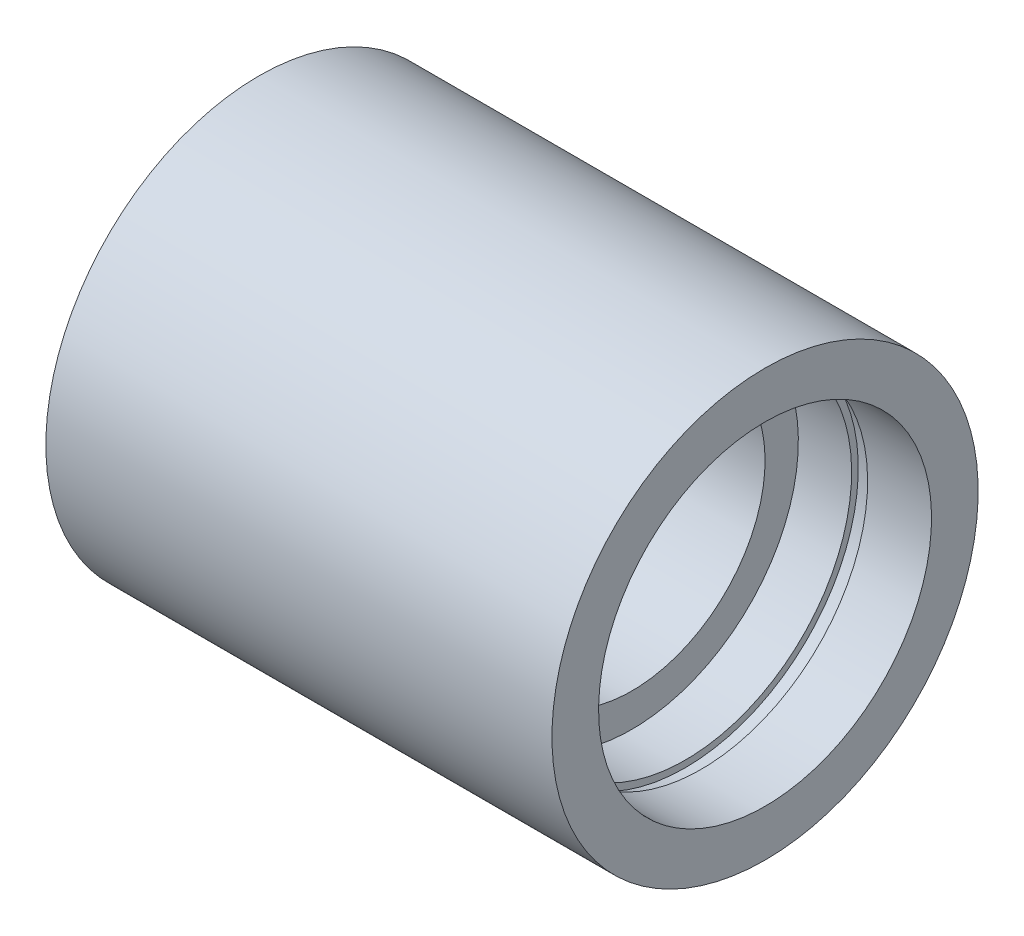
ISO-10303-21;
HEADER;
FILE_DESCRIPTION(('STEP AP214'),'2;1');
FILE_NAME('part.step','',(''),(''),'','','');
FILE_SCHEMA(('AUTOMOTIVE_DESIGN { 1 0 10303 214 1 1 1 1 }'));
ENDSEC;
DATA;
#1=APPLICATION_CONTEXT('core data for automotive mechanical design processes');
#2=APPLICATION_PROTOCOL_DEFINITION('international standard','automotive_design',2000,#1);
#3=PRODUCT_CONTEXT('',#1,'mechanical');
#4=PRODUCT('Part','Part','',(#3));
#5=PRODUCT_RELATED_PRODUCT_CATEGORY('part','',(#4));
#6=PRODUCT_DEFINITION_FORMATION('','',#4);
#7=PRODUCT_DEFINITION_CONTEXT('part definition',#1,'design');
#8=PRODUCT_DEFINITION('design','',#6,#7);
#9=PRODUCT_DEFINITION_SHAPE('','',#8);
#10=(LENGTH_UNIT() NAMED_UNIT(*) SI_UNIT(.MILLI.,.METRE.));
#11=(NAMED_UNIT(*) PLANE_ANGLE_UNIT() SI_UNIT($,.RADIAN.));
#12=(NAMED_UNIT(*) SI_UNIT($,.STERADIAN.) SOLID_ANGLE_UNIT());
#13=UNCERTAINTY_MEASURE_WITH_UNIT(LENGTH_MEASURE(1.E-05),#10,'distance_accuracy_value','');
#14=(GEOMETRIC_REPRESENTATION_CONTEXT(3) GLOBAL_UNCERTAINTY_ASSIGNED_CONTEXT((#13)) GLOBAL_UNIT_ASSIGNED_CONTEXT((#10,
#11,#12)) REPRESENTATION_CONTEXT('',''));
#15=CARTESIAN_POINT('',(0.,0.,0.));
#16=DIRECTION('',(0.,0.,1.));
#17=DIRECTION('',(1.,0.,0.));
#18=AXIS2_PLACEMENT_3D('',#15,#16,#17);
#19=CARTESIAN_POINT('',(0.,0.,0.));
#20=DIRECTION('',(1.,0.,0.));
#21=DIRECTION('',(0.,0.999999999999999,0.));
#22=AXIS2_PLACEMENT_3D('',#19,#20,#21);
#23=CYLINDRICAL_SURFACE('',#22,16.);
#24=CARTESIAN_POINT('',(-38.,0.,0.));
#25=DIRECTION('',(1.,0.,0.));
#26=DIRECTION('',(0.,0.999999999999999,0.));
#27=AXIS2_PLACEMENT_3D('',#24,#25,#26);
#28=CIRCLE('',#27,16.);
#29=CARTESIAN_POINT('',(-38.,16.,0.));
#30=VERTEX_POINT('',#29);
#31=EDGE_CURVE('E12',#30,#30,#28,.T.);
#32=ORIENTED_EDGE('',*,*,#31,.T.);
#33=EDGE_LOOP('',(#32));
#34=FACE_BOUND('',#33,.T.);
#35=CARTESIAN_POINT('',(0.,0.,0.));
#36=DIRECTION('',(1.,0.,0.));
#37=DIRECTION('',(0.,0.999999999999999,0.));
#38=AXIS2_PLACEMENT_3D('',#35,#36,#37);
#39=CIRCLE('',#38,16.);
#40=CARTESIAN_POINT('',(0.,16.,0.));
#41=VERTEX_POINT('',#40);
#42=EDGE_CURVE('E84',#41,#41,#39,.T.);
#43=ORIENTED_EDGE('',*,*,#42,.F.);
#44=EDGE_LOOP('',(#43));
#45=FACE_BOUND('',#44,.T.);
#46=ADVANCED_FACE('F38',(#34,#45),#23,.T.);
#47=CARTESIAN_POINT('',(-38.,16.,0.));
#48=DIRECTION('',(-1.,0.,0.));
#49=DIRECTION('',(0.,-0.999999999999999,0.));
#50=AXIS2_PLACEMENT_3D('',#47,#48,#49);
#51=PLANE('',#50);
#52=CARTESIAN_POINT('',(-38.,0.,0.));
#53=DIRECTION('',(1.,0.,0.));
#54=DIRECTION('',(0.,0.999999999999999,0.));
#55=AXIS2_PLACEMENT_3D('',#52,#53,#54);
#56=CIRCLE('',#55,12.5);
#57=CARTESIAN_POINT('',(-38.,12.5,0.));
#58=VERTEX_POINT('',#57);
#59=EDGE_CURVE('E44',#58,#58,#56,.T.);
#60=ORIENTED_EDGE('',*,*,#59,.T.);
#61=EDGE_LOOP('',(#60));
#62=FACE_BOUND('',#61,.T.);
#63=ORIENTED_EDGE('',*,*,#31,.F.);
#64=EDGE_LOOP('',(#63));
#65=FACE_BOUND('',#64,.T.);
#66=ADVANCED_FACE('F92',(#62,#65),#51,.T.);
#67=CARTESIAN_POINT('',(0.,0.,0.));
#68=DIRECTION('',(1.,0.,0.));
#69=DIRECTION('',(0.,0.999999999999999,0.));
#70=AXIS2_PLACEMENT_3D('',#67,#68,#69);
#71=CYLINDRICAL_SURFACE('',#70,12.5);
#72=CARTESIAN_POINT('',(-29.,0.,0.));
#73=DIRECTION('',(1.,0.,0.));
#74=DIRECTION('',(0.,0.999999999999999,0.));
#75=AXIS2_PLACEMENT_3D('',#72,#73,#74);
#76=CIRCLE('',#75,12.5);
#77=CARTESIAN_POINT('',(-29.,12.5,0.));
#78=VERTEX_POINT('',#77);
#79=EDGE_CURVE('E48',#78,#78,#76,.T.);
#80=ORIENTED_EDGE('',*,*,#79,.T.);
#81=EDGE_LOOP('',(#80));
#82=FACE_BOUND('',#81,.T.);
#83=ORIENTED_EDGE('',*,*,#59,.F.);
#84=EDGE_LOOP('',(#83));
#85=FACE_BOUND('',#84,.T.);
#86=ADVANCED_FACE('F96',(#82,#85),#71,.F.);
#87=CARTESIAN_POINT('',(-29.,12.5,0.));
#88=DIRECTION('',(-1.,0.,0.));
#89=DIRECTION('',(0.,-0.999999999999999,0.));
#90=AXIS2_PLACEMENT_3D('',#87,#88,#89);
#91=PLANE('',#90);
#92=CARTESIAN_POINT('',(-29.,0.,0.));
#93=DIRECTION('',(1.,0.,0.));
#94=DIRECTION('',(0.,0.999999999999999,0.));
#95=AXIS2_PLACEMENT_3D('',#92,#93,#94);
#96=CIRCLE('',#95,4.);
#97=CARTESIAN_POINT('',(-29.,3.99999999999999,0.));
#98=VERTEX_POINT('',#97);
#99=EDGE_CURVE('E52',#98,#98,#96,.T.);
#100=ORIENTED_EDGE('',*,*,#99,.T.);
#101=EDGE_LOOP('',(#100));
#102=FACE_BOUND('',#101,.T.);
#103=ORIENTED_EDGE('',*,*,#79,.F.);
#104=EDGE_LOOP('',(#103));
#105=FACE_BOUND('',#104,.T.);
#106=ADVANCED_FACE('F100',(#102,#105),#91,.T.);
#107=CARTESIAN_POINT('',(0.,0.,0.));
#108=DIRECTION('',(1.,0.,0.));
#109=DIRECTION('',(0.,0.999999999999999,0.));
#110=AXIS2_PLACEMENT_3D('',#107,#108,#109);
#111=CYLINDRICAL_SURFACE('',#110,4.);
#112=CARTESIAN_POINT('',(-24.,0.,0.));
#113=DIRECTION('',(1.,0.,0.));
#114=DIRECTION('',(0.,0.999999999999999,0.));
#115=AXIS2_PLACEMENT_3D('',#112,#113,#114);
#116=CIRCLE('',#115,4.);
#117=CARTESIAN_POINT('',(-24.,3.99999999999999,0.));
#118=VERTEX_POINT('',#117);
#119=EDGE_CURVE('E57',#118,#118,#116,.T.);
#120=ORIENTED_EDGE('',*,*,#119,.T.);
#121=EDGE_LOOP('',(#120));
#122=FACE_BOUND('',#121,.T.);
#123=ORIENTED_EDGE('',*,*,#99,.F.);
#124=EDGE_LOOP('',(#123));
#125=FACE_BOUND('',#124,.T.);
#126=ADVANCED_FACE('F107',(#122,#125),#111,.F.);
#127=CARTESIAN_POINT('',(-24.,3.99999999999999,0.));
#128=DIRECTION('',(1.,0.,0.));
#129=DIRECTION('',(0.,0.999999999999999,0.));
#130=AXIS2_PLACEMENT_3D('',#127,#128,#129);
#131=PLANE('',#130);
#132=CARTESIAN_POINT('',(-24.,0.,0.));
#133=DIRECTION('',(1.,0.,0.));
#134=DIRECTION('',(0.,0.999999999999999,0.));
#135=AXIS2_PLACEMENT_3D('',#132,#133,#134);
#136=CIRCLE('',#135,10.);
#137=CARTESIAN_POINT('',(-24.,9.99999999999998,0.));
#138=VERTEX_POINT('',#137);
#139=EDGE_CURVE('E60',#138,#138,#136,.T.);
#140=ORIENTED_EDGE('',*,*,#139,.T.);
#141=EDGE_LOOP('',(#140));
#142=FACE_BOUND('',#141,.T.);
#143=ORIENTED_EDGE('',*,*,#119,.F.);
#144=EDGE_LOOP('',(#143));
#145=FACE_BOUND('',#144,.T.);
#146=ADVANCED_FACE('F111',(#142,#145),#131,.T.);
#147=CARTESIAN_POINT('',(0.,0.,0.));
#148=DIRECTION('',(1.,0.,0.));
#149=DIRECTION('',(0.,0.999999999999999,0.));
#150=AXIS2_PLACEMENT_3D('',#147,#148,#149);
#151=CYLINDRICAL_SURFACE('',#150,10.);
#152=CARTESIAN_POINT('',(-10.,0.,0.));
#153=DIRECTION('',(1.,0.,0.));
#154=DIRECTION('',(0.,0.999999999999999,0.));
#155=AXIS2_PLACEMENT_3D('',#152,#153,#154);
#156=CIRCLE('',#155,10.);
#157=CARTESIAN_POINT('',(-10.,9.99999999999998,0.));
#158=VERTEX_POINT('',#157);
#159=EDGE_CURVE('E63',#158,#158,#156,.T.);
#160=ORIENTED_EDGE('',*,*,#159,.T.);
#161=EDGE_LOOP('',(#160));
#162=FACE_BOUND('',#161,.T.);
#163=ORIENTED_EDGE('',*,*,#139,.F.);
#164=EDGE_LOOP('',(#163));
#165=FACE_BOUND('',#164,.T.);
#166=ADVANCED_FACE('F115',(#162,#165),#151,.F.);
#167=CARTESIAN_POINT('',(-10.,9.99999999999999,0.));
#168=DIRECTION('',(1.,0.,0.));
#169=DIRECTION('',(0.,0.999999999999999,0.));
#170=AXIS2_PLACEMENT_3D('',#167,#168,#169);
#171=PLANE('',#170);
#172=CARTESIAN_POINT('',(-10.,0.,0.));
#173=DIRECTION('',(1.,0.,0.));
#174=DIRECTION('',(0.,0.999999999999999,0.));
#175=AXIS2_PLACEMENT_3D('',#172,#173,#174);
#176=CIRCLE('',#175,12.5);
#177=CARTESIAN_POINT('',(-10.,12.5,0.));
#178=VERTEX_POINT('',#177);
#179=EDGE_CURVE('E66',#178,#178,#176,.T.);
#180=ORIENTED_EDGE('',*,*,#179,.T.);
#181=EDGE_LOOP('',(#180));
#182=FACE_BOUND('',#181,.T.);
#183=ORIENTED_EDGE('',*,*,#159,.F.);
#184=EDGE_LOOP('',(#183));
#185=FACE_BOUND('',#184,.T.);
#186=ADVANCED_FACE('F119',(#182,#185),#171,.T.);
#187=CARTESIAN_POINT('',(0.,0.,0.));
#188=DIRECTION('',(1.,0.,0.));
#189=DIRECTION('',(0.,0.999999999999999,0.));
#190=AXIS2_PLACEMENT_3D('',#187,#188,#189);
#191=CYLINDRICAL_SURFACE('',#190,12.5);
#192=CARTESIAN_POINT('',(-6.00000000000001,0.,0.));
#193=DIRECTION('',(1.,0.,0.));
#194=DIRECTION('',(0.,0.999999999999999,0.));
#195=AXIS2_PLACEMENT_3D('',#192,#193,#194);
#196=CIRCLE('',#195,12.5);
#197=CARTESIAN_POINT('',(-6.00000000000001,12.5,0.));
#198=VERTEX_POINT('',#197);
#199=EDGE_CURVE('E69',#198,#198,#196,.T.);
#200=ORIENTED_EDGE('',*,*,#199,.T.);
#201=EDGE_LOOP('',(#200));
#202=FACE_BOUND('',#201,.T.);
#203=ORIENTED_EDGE('',*,*,#179,.F.);
#204=EDGE_LOOP('',(#203));
#205=FACE_BOUND('',#204,.T.);
#206=ADVANCED_FACE('F123',(#202,#205),#191,.F.);
#207=CARTESIAN_POINT('',(-6.00000000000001,12.5,0.));
#208=DIRECTION('',(1.,0.,0.));
#209=DIRECTION('',(0.,0.999999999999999,0.));
#210=AXIS2_PLACEMENT_3D('',#207,#208,#209);
#211=PLANE('',#210);
#212=CARTESIAN_POINT('',(-6.00000000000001,0.,0.));
#213=DIRECTION('',(1.,0.,0.));
#214=DIRECTION('',(0.,0.999999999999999,0.));
#215=AXIS2_PLACEMENT_3D('',#212,#213,#214);
#216=CIRCLE('',#215,13.);
#217=CARTESIAN_POINT('',(-6.00000000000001,13.,0.));
#218=VERTEX_POINT('',#217);
#219=EDGE_CURVE('E72',#218,#218,#216,.T.);
#220=ORIENTED_EDGE('',*,*,#219,.T.);
#221=EDGE_LOOP('',(#220));
#222=FACE_BOUND('',#221,.T.);
#223=ORIENTED_EDGE('',*,*,#199,.F.);
#224=EDGE_LOOP('',(#223));
#225=FACE_BOUND('',#224,.T.);
#226=ADVANCED_FACE('F127',(#222,#225),#211,.T.);
#227=CARTESIAN_POINT('',(0.,0.,0.));
#228=DIRECTION('',(1.,0.,0.));
#229=DIRECTION('',(0.,0.999999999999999,0.));
#230=AXIS2_PLACEMENT_3D('',#227,#228,#229);
#231=CYLINDRICAL_SURFACE('',#230,13.);
#232=CARTESIAN_POINT('',(-4.8,0.,0.));
#233=DIRECTION('',(1.,0.,0.));
#234=DIRECTION('',(0.,0.999999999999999,0.));
#235=AXIS2_PLACEMENT_3D('',#232,#233,#234);
#236=CIRCLE('',#235,13.);
#237=CARTESIAN_POINT('',(-4.8,13.,0.));
#238=VERTEX_POINT('',#237);
#239=EDGE_CURVE('E75',#238,#238,#236,.T.);
#240=ORIENTED_EDGE('',*,*,#239,.T.);
#241=EDGE_LOOP('',(#240));
#242=FACE_BOUND('',#241,.T.);
#243=ORIENTED_EDGE('',*,*,#219,.F.);
#244=EDGE_LOOP('',(#243));
#245=FACE_BOUND('',#244,.T.);
#246=ADVANCED_FACE('F131',(#242,#245),#231,.F.);
#247=CARTESIAN_POINT('',(-4.8,13.,0.));
#248=DIRECTION('',(-1.,0.,0.));
#249=DIRECTION('',(0.,-0.999999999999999,0.));
#250=AXIS2_PLACEMENT_3D('',#247,#248,#249);
#251=PLANE('',#250);
#252=CARTESIAN_POINT('',(-4.8,0.,0.));
#253=DIRECTION('',(1.,0.,0.));
#254=DIRECTION('',(0.,0.999999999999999,0.));
#255=AXIS2_PLACEMENT_3D('',#252,#253,#254);
#256=CIRCLE('',#255,12.5);
#257=CARTESIAN_POINT('',(-4.8,12.5,0.));
#258=VERTEX_POINT('',#257);
#259=EDGE_CURVE('E78',#258,#258,#256,.T.);
#260=ORIENTED_EDGE('',*,*,#259,.T.);
#261=EDGE_LOOP('',(#260));
#262=FACE_BOUND('',#261,.T.);
#263=ORIENTED_EDGE('',*,*,#239,.F.);
#264=EDGE_LOOP('',(#263));
#265=FACE_BOUND('',#264,.T.);
#266=ADVANCED_FACE('F135',(#262,#265),#251,.T.);
#267=CARTESIAN_POINT('',(0.,0.,0.));
#268=DIRECTION('',(1.,0.,0.));
#269=DIRECTION('',(0.,0.999999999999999,0.));
#270=AXIS2_PLACEMENT_3D('',#267,#268,#269);
#271=CYLINDRICAL_SURFACE('',#270,12.5);
#272=CARTESIAN_POINT('',(0.,0.,0.));
#273=DIRECTION('',(1.,0.,0.));
#274=DIRECTION('',(0.,0.999999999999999,0.));
#275=AXIS2_PLACEMENT_3D('',#272,#273,#274);
#276=CIRCLE('',#275,12.5);
#277=CARTESIAN_POINT('',(0.,12.5,0.));
#278=VERTEX_POINT('',#277);
#279=EDGE_CURVE('E81',#278,#278,#276,.T.);
#280=ORIENTED_EDGE('',*,*,#279,.T.);
#281=EDGE_LOOP('',(#280));
#282=FACE_BOUND('',#281,.T.);
#283=ORIENTED_EDGE('',*,*,#259,.F.);
#284=EDGE_LOOP('',(#283));
#285=FACE_BOUND('',#284,.T.);
#286=ADVANCED_FACE('F139',(#282,#285),#271,.F.);
#287=CARTESIAN_POINT('',(0.,16.,0.));
#288=DIRECTION('',(1.,0.,0.));
#289=DIRECTION('',(0.,0.999999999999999,0.));
#290=AXIS2_PLACEMENT_3D('',#287,#288,#289);
#291=PLANE('',#290);
#292=ORIENTED_EDGE('',*,*,#42,.T.);
#293=EDGE_LOOP('',(#292));
#294=FACE_BOUND('',#293,.T.);
#295=ORIENTED_EDGE('',*,*,#279,.F.);
#296=EDGE_LOOP('',(#295));
#297=FACE_BOUND('',#296,.T.);
#298=ADVANCED_FACE('F88',(#294,#297),#291,.T.);
#299=CLOSED_SHELL('',(#46,#66,#86,#106,#126,#146,#166,#186,#206,#226,#246,#266,#286,#298));
#300=MANIFOLD_SOLID_BREP('B2',#299);
#301=ADVANCED_BREP_SHAPE_REPRESENTATION('',(#18,#300),#14);
#302=SHAPE_DEFINITION_REPRESENTATION(#9,#301);
ENDSEC;
END-ISO-10303-21;
